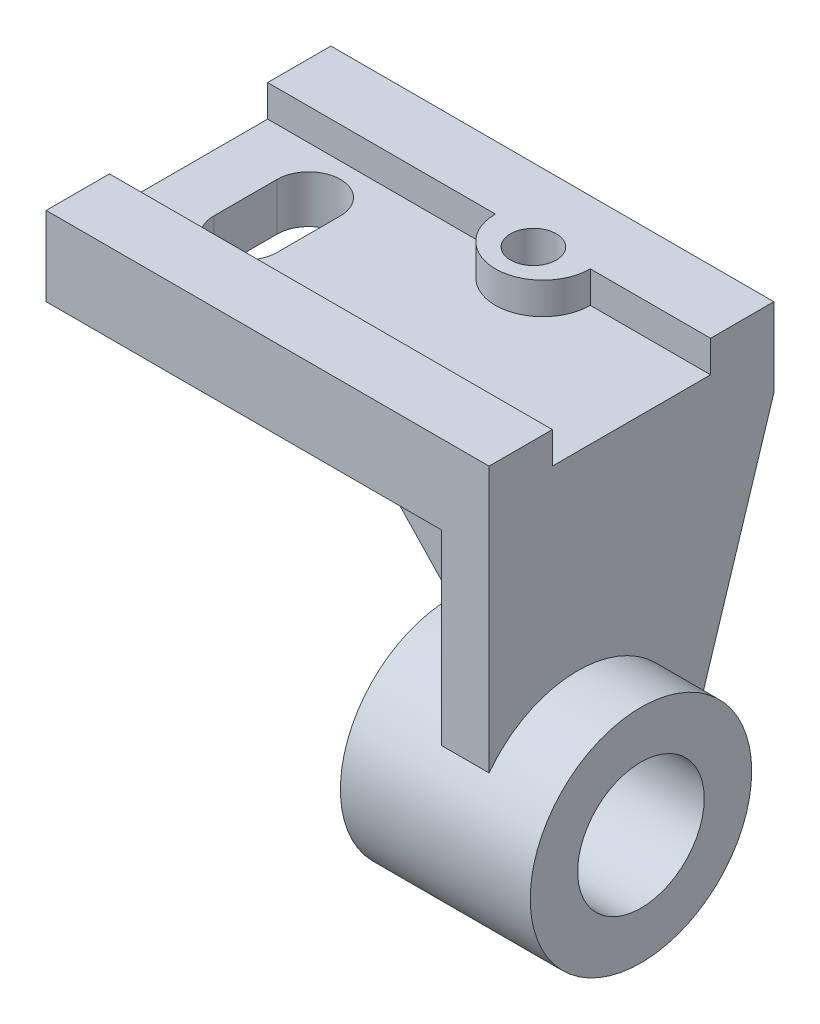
ISO-10303-21;
HEADER;
FILE_DESCRIPTION(('STEP AP214'),'2;1');
FILE_NAME('part.step','',(''),(''),'','','');
FILE_SCHEMA(('AUTOMOTIVE_DESIGN { 1 0 10303 214 1 1 1 1 }'));
ENDSEC;
DATA;
#1=APPLICATION_CONTEXT('core data for automotive mechanical design processes');
#2=APPLICATION_PROTOCOL_DEFINITION('international standard','automotive_design',2000,#1);
#3=PRODUCT_CONTEXT('',#1,'mechanical');
#4=PRODUCT('Part','Part','',(#3));
#5=PRODUCT_RELATED_PRODUCT_CATEGORY('part','',(#4));
#6=PRODUCT_DEFINITION_FORMATION('','',#4);
#7=PRODUCT_DEFINITION_CONTEXT('part definition',#1,'design');
#8=PRODUCT_DEFINITION('design','',#6,#7);
#9=PRODUCT_DEFINITION_SHAPE('','',#8);
#10=(LENGTH_UNIT() NAMED_UNIT(*) SI_UNIT(.MILLI.,.METRE.));
#11=(NAMED_UNIT(*) PLANE_ANGLE_UNIT() SI_UNIT($,.RADIAN.));
#12=(NAMED_UNIT(*) SI_UNIT($,.STERADIAN.) SOLID_ANGLE_UNIT());
#13=UNCERTAINTY_MEASURE_WITH_UNIT(LENGTH_MEASURE(1.E-05),#10,'distance_accuracy_value','');
#14=(GEOMETRIC_REPRESENTATION_CONTEXT(3) GLOBAL_UNCERTAINTY_ASSIGNED_CONTEXT((#13)) GLOBAL_UNIT_ASSIGNED_CONTEXT((#10,
#11,#12)) REPRESENTATION_CONTEXT('',''));
#15=CARTESIAN_POINT('',(0.,0.,0.));
#16=DIRECTION('',(0.,0.,1.));
#17=DIRECTION('',(1.,0.,0.));
#18=AXIS2_PLACEMENT_3D('',#15,#16,#17);
#19=CARTESIAN_POINT('',(-15.,-80.,62.));
#20=DIRECTION('',(-1.,0.,0.));
#21=DIRECTION('',(0.,0.,1.));
#22=AXIS2_PLACEMENT_3D('',#19,#20,#21);
#23=PLANE('',#22);
#24=DIRECTION('',(0.,0.,1.));
#25=VECTOR('',#24,1.);
#26=CARTESIAN_POINT('',(-15.,0.,0.));
#27=LINE('',#26,#25);
#28=CARTESIAN_POINT('',(-15.,0.,67.));
#29=VERTEX_POINT('',#28);
#30=CARTESIAN_POINT('',(-15.,0.,90.));
#31=VERTEX_POINT('',#30);
#32=EDGE_CURVE('E47',#29,#31,#27,.T.);
#33=ORIENTED_EDGE('',*,*,#32,.F.);
#34=DIRECTION('',(0.,-1.,0.));
#35=VECTOR('',#34,1.);
#36=CARTESIAN_POINT('',(-15.,-80.,67.));
#37=LINE('',#36,#35);
#38=CARTESIAN_POINT('',(-15.,-45.3589838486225,67.));
#39=VERTEX_POINT('',#38);
#40=EDGE_CURVE('E221',#29,#39,#37,.T.);
#41=ORIENTED_EDGE('',*,*,#40,.T.);
#42=CARTESIAN_POINT('',(-15.,-80.,62.));
#43=DIRECTION('',(-1.,0.,0.));
#44=DIRECTION('',(0.,0.,1.));
#45=AXIS2_PLACEMENT_3D('',#42,#43,#44);
#46=CIRCLE('',#45,35.);
#47=CARTESIAN_POINT('',(-15.,-59.,90.));
#48=VERTEX_POINT('',#47);
#49=EDGE_CURVE('E241',#48,#39,#46,.T.);
#50=ORIENTED_EDGE('',*,*,#49,.F.);
#51=DIRECTION('',(0.,-1.,0.));
#52=VECTOR('',#51,1.);
#53=CARTESIAN_POINT('',(-15.,0.,90.));
#54=LINE('',#53,#52);
#55=EDGE_CURVE('E248',#31,#48,#54,.T.);
#56=ORIENTED_EDGE('',*,*,#55,.F.);
#57=EDGE_LOOP('',(#33,#41,#50,#56));
#58=FACE_BOUND('',#57,.T.);
#59=ADVANCED_FACE('F43',(#58),#23,.T.);
#60=CARTESIAN_POINT('',(0.,0.,0.));
#61=DIRECTION('',(0.,-1.,0.));
#62=DIRECTION('',(0.,0.,-1.));
#63=AXIS2_PLACEMENT_3D('',#60,#61,#62);
#64=PLANE('',#63);
#65=DIRECTION('',(-1.,0.,0.));
#66=VECTOR('',#65,1.);
#67=CARTESIAN_POINT('',(-60.0000125,0.,57.));
#68=LINE('',#67,#66);
#69=CARTESIAN_POINT('',(-73.,0.,57.));
#70=VERTEX_POINT('',#69);
#71=CARTESIAN_POINT('',(-15.,0.,57.));
#72=VERTEX_POINT('',#71);
#73=EDGE_CURVE('E60',#70,#72,#68,.F.);
#74=ORIENTED_EDGE('',*,*,#73,.F.);
#75=DIRECTION('',(0.,0.,-1.));
#76=VECTOR('',#75,1.);
#77=CARTESIAN_POINT('',(-73.,0.,62.));
#78=LINE('',#77,#76);
#79=CARTESIAN_POINT('',(-73.,0.,67.));
#80=VERTEX_POINT('',#79);
#81=EDGE_CURVE('E64',#80,#70,#78,.T.);
#82=ORIENTED_EDGE('',*,*,#81,.F.);
#83=DIRECTION('',(-1.,0.,0.));
#84=VECTOR('',#83,1.);
#85=CARTESIAN_POINT('',(-60.0000125,0.,67.));
#86=LINE('',#85,#84);
#87=EDGE_CURVE('E199',#80,#29,#86,.F.);
#88=ORIENTED_EDGE('',*,*,#87,.T.);
#89=ORIENTED_EDGE('',*,*,#32,.T.);
#90=DIRECTION('',(1.,0.,0.));
#91=VECTOR('',#90,1.);
#92=CARTESIAN_POINT('',(0.,0.,90.));
#93=LINE('',#92,#91);
#94=CARTESIAN_POINT('',(-140.,0.,90.));
#95=VERTEX_POINT('',#94);
#96=EDGE_CURVE('E383',#95,#31,#93,.T.);
#97=ORIENTED_EDGE('',*,*,#96,.F.);
#98=DIRECTION('',(0.,0.,1.));
#99=VECTOR('',#98,1.);
#100=CARTESIAN_POINT('',(-140.,0.,0.));
#101=LINE('',#100,#99);
#102=CARTESIAN_POINT('',(-140.,0.,0.));
#103=VERTEX_POINT('',#102);
#104=EDGE_CURVE('E379',#103,#95,#101,.T.);
#105=ORIENTED_EDGE('',*,*,#104,.F.);
#106=DIRECTION('',(-1.,0.,0.));
#107=VECTOR('',#106,1.);
#108=CARTESIAN_POINT('',(0.,0.,0.));
#109=LINE('',#108,#107);
#110=CARTESIAN_POINT('',(-15.,0.,0.));
#111=VERTEX_POINT('',#110);
#112=EDGE_CURVE('E354',#111,#103,#109,.T.);
#113=ORIENTED_EDGE('',*,*,#112,.F.);
#114=EDGE_CURVE('E245',#111,#72,#27,.T.);
#115=ORIENTED_EDGE('',*,*,#114,.T.);
#116=EDGE_LOOP('',(#74,#82,#88,#89,#97,#105,#113,#115));
#117=FACE_BOUND('',#116,.T.);
#118=CARTESIAN_POINT('',(-53.,0.,23.));
#119=DIRECTION('',(0.,1.,0.));
#120=DIRECTION('',(0.,0.,1.));
#121=AXIS2_PLACEMENT_3D('',#118,#119,#120);
#122=CIRCLE('',#121,7.22143953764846);
#123=CARTESIAN_POINT('',(-53.,0.,30.2214395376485));
#124=VERTEX_POINT('',#123);
#125=EDGE_CURVE('E317',#124,#124,#122,.T.);
#126=ORIENTED_EDGE('',*,*,#125,.T.);
#127=EDGE_LOOP('',(#126));
#128=FACE_BOUND('',#127,.T.);
#129=CARTESIAN_POINT('',(-112.,0.,35.));
#130=DIRECTION('',(0.,1.,0.));
#131=DIRECTION('',(0.,0.,1.));
#132=AXIS2_PLACEMENT_3D('',#129,#130,#131);
#133=CIRCLE('',#132,10.);
#134=CARTESIAN_POINT('',(-102.,0.,35.));
#135=VERTEX_POINT('',#134);
#136=CARTESIAN_POINT('',(-122.,0.,35.));
#137=VERTEX_POINT('',#136);
#138=EDGE_CURVE('E287',#135,#137,#133,.T.);
#139=ORIENTED_EDGE('',*,*,#138,.T.);
#140=DIRECTION('',(0.,0.,1.));
#141=VECTOR('',#140,1.);
#142=CARTESIAN_POINT('',(-122.,0.,35.));
#143=LINE('',#142,#141);
#144=CARTESIAN_POINT('',(-122.,0.,55.));
#145=VERTEX_POINT('',#144);
#146=EDGE_CURVE('E290',#137,#145,#143,.T.);
#147=ORIENTED_EDGE('',*,*,#146,.T.);
#148=CARTESIAN_POINT('',(-112.,0.,55.));
#149=DIRECTION('',(0.,1.,0.));
#150=DIRECTION('',(0.,0.,1.));
#151=AXIS2_PLACEMENT_3D('',#148,#149,#150);
#152=CIRCLE('',#151,10.);
#153=CARTESIAN_POINT('',(-102.,0.,55.));
#154=VERTEX_POINT('',#153);
#155=EDGE_CURVE('E294',#145,#154,#152,.T.);
#156=ORIENTED_EDGE('',*,*,#155,.T.);
#157=DIRECTION('',(0.,0.,-1.));
#158=VECTOR('',#157,1.);
#159=CARTESIAN_POINT('',(-102.,0.,55.));
#160=LINE('',#159,#158);
#161=EDGE_CURVE('E297',#154,#135,#160,.T.);
#162=ORIENTED_EDGE('',*,*,#161,.T.);
#163=EDGE_LOOP('',(#139,#147,#156,#162));
#164=FACE_BOUND('',#163,.T.);
#165=ADVANCED_FACE('F410',(#117,#128,#164),#64,.T.);
#166=CARTESIAN_POINT('',(0.,25.,0.));
#167=DIRECTION('',(0.,-1.,0.));
#168=DIRECTION('',(0.,0.,-1.));
#169=AXIS2_PLACEMENT_3D('',#166,#167,#168);
#170=PLANE('',#169);
#171=CARTESIAN_POINT('',(-53.,25.,23.));
#172=DIRECTION('',(0.,1.,0.));
#173=DIRECTION('',(0.,0.,1.));
#174=AXIS2_PLACEMENT_3D('',#171,#172,#173);
#175=CIRCLE('',#174,7.22143953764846);
#176=CARTESIAN_POINT('',(-53.,25.,30.2214395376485));
#177=VERTEX_POINT('',#176);
#178=EDGE_CURVE('E310',#177,#177,#175,.T.);
#179=ORIENTED_EDGE('',*,*,#178,.F.);
#180=EDGE_LOOP('',(#179));
#181=FACE_BOUND('',#180,.T.);
#182=DIRECTION('',(0.,0.,1.));
#183=VECTOR('',#182,1.);
#184=CARTESIAN_POINT('',(-140.,25.,0.));
#185=LINE('',#184,#183);
#186=CARTESIAN_POINT('',(-140.,25.,0.));
#187=VERTEX_POINT('',#186);
#188=CARTESIAN_POINT('',(-140.,25.,20.));
#189=VERTEX_POINT('',#188);
#190=EDGE_CURVE('E372',#187,#189,#185,.T.);
#191=ORIENTED_EDGE('',*,*,#190,.T.);
#192=DIRECTION('',(-1.,0.,0.));
#193=VECTOR('',#192,1.);
#194=CARTESIAN_POINT('',(-140.,25.,20.));
#195=LINE('',#194,#193);
#196=CARTESIAN_POINT('',(-68.,25.,20.));
#197=VERTEX_POINT('',#196);
#198=EDGE_CURVE('E327',#197,#189,#195,.T.);
#199=ORIENTED_EDGE('',*,*,#198,.F.);
#200=CARTESIAN_POINT('',(-53.,25.,20.));
#201=DIRECTION('',(0.,-1.,0.));
#202=DIRECTION('',(0.,0.,1.));
#203=AXIS2_PLACEMENT_3D('',#200,#201,#202);
#204=CIRCLE('',#203,15.);
#205=CARTESIAN_POINT('',(-38.,25.,20.));
#206=VERTEX_POINT('',#205);
#207=EDGE_CURVE('E347',#206,#197,#204,.T.);
#208=ORIENTED_EDGE('',*,*,#207,.F.);
#209=DIRECTION('',(-1.,0.,0.));
#210=VECTOR('',#209,1.);
#211=CARTESIAN_POINT('',(-38.,25.,20.));
#212=LINE('',#211,#210);
#213=CARTESIAN_POINT('',(0.,25.,20.));
#214=VERTEX_POINT('',#213);
#215=EDGE_CURVE('E344',#214,#206,#212,.T.);
#216=ORIENTED_EDGE('',*,*,#215,.F.);
#217=DIRECTION('',(0.,0.,-1.));
#218=VECTOR('',#217,1.);
#219=CARTESIAN_POINT('',(0.,25.,0.));
#220=LINE('',#219,#218);
#221=CARTESIAN_POINT('',(0.,25.,0.));
#222=VERTEX_POINT('',#221);
#223=EDGE_CURVE('E369',#214,#222,#220,.T.);
#224=ORIENTED_EDGE('',*,*,#223,.T.);
#225=DIRECTION('',(-1.,0.,0.));
#226=VECTOR('',#225,1.);
#227=CARTESIAN_POINT('',(0.,25.,0.));
#228=LINE('',#227,#226);
#229=EDGE_CURVE('E368',#222,#187,#228,.T.);
#230=ORIENTED_EDGE('',*,*,#229,.T.);
#231=EDGE_LOOP('',(#191,#199,#208,#216,#224,#230));
#232=FACE_BOUND('',#231,.T.);
#233=ADVANCED_FACE('F426',(#181,#232),#170,.F.);
#234=CARTESIAN_POINT('',(0.,25.,0.));
#235=DIRECTION('',(-1.,0.,0.));
#236=DIRECTION('',(0.,0.,1.));
#237=AXIS2_PLACEMENT_3D('',#234,#235,#236);
#238=PLANE('',#237);
#239=CARTESIAN_POINT('',(0.,-80.,62.));
#240=DIRECTION('',(-1.,0.,0.));
#241=DIRECTION('',(0.,0.,1.));
#242=AXIS2_PLACEMENT_3D('',#239,#240,#241);
#243=CIRCLE('',#242,35.);
#244=CARTESIAN_POINT('',(0.,-59.,90.));
#245=VERTEX_POINT('',#244);
#246=CARTESIAN_POINT('',(0.,-90.55070893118,28.6281175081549));
#247=VERTEX_POINT('',#246);
#248=EDGE_CURVE('E237',#245,#247,#243,.T.);
#249=ORIENTED_EDGE('',*,*,#248,.T.);
#250=DIRECTION('',(0.,0.953482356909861,-0.301448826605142));
#251=VECTOR('',#250,1.);
#252=CARTESIAN_POINT('',(0.,0.,0.));
#253=LINE('',#252,#251);
#254=CARTESIAN_POINT('',(0.,0.,0.));
#255=VERTEX_POINT('',#254);
#256=EDGE_CURVE('E280',#247,#255,#253,.T.);
#257=ORIENTED_EDGE('',*,*,#256,.T.);
#258=DIRECTION('',(0.,-1.,0.));
#259=VECTOR('',#258,1.);
#260=CARTESIAN_POINT('',(0.,25.,0.));
#261=LINE('',#260,#259);
#262=EDGE_CURVE('E53',#222,#255,#261,.T.);
#263=ORIENTED_EDGE('',*,*,#262,.F.);
#264=ORIENTED_EDGE('',*,*,#223,.F.);
#265=DIRECTION('',(0.,1.,0.));
#266=VECTOR('',#265,1.);
#267=CARTESIAN_POINT('',(0.,15.,20.));
#268=LINE('',#267,#266);
#269=CARTESIAN_POINT('',(0.,15.,20.));
#270=VERTEX_POINT('',#269);
#271=EDGE_CURVE('E359',#270,#214,#268,.T.);
#272=ORIENTED_EDGE('',*,*,#271,.F.);
#273=DIRECTION('',(0.,0.,-1.));
#274=VECTOR('',#273,1.);
#275=CARTESIAN_POINT('',(0.,15.,20.));
#276=LINE('',#275,#274);
#277=CARTESIAN_POINT('',(0.,15.,70.));
#278=VERTEX_POINT('',#277);
#279=EDGE_CURVE('E330',#278,#270,#276,.T.);
#280=ORIENTED_EDGE('',*,*,#279,.F.);
#281=DIRECTION('',(0.,1.,0.));
#282=VECTOR('',#281,1.);
#283=CARTESIAN_POINT('',(0.,15.,70.));
#284=LINE('',#283,#282);
#285=CARTESIAN_POINT('',(0.,25.,70.));
#286=VERTEX_POINT('',#285);
#287=EDGE_CURVE('E361',#278,#286,#284,.T.);
#288=ORIENTED_EDGE('',*,*,#287,.T.);
#289=CARTESIAN_POINT('',(0.,25.,90.));
#290=VERTEX_POINT('',#289);
#291=EDGE_CURVE('E365',#290,#286,#220,.T.);
#292=ORIENTED_EDGE('',*,*,#291,.F.);
#293=DIRECTION('',(0.,-1.,0.));
#294=VECTOR('',#293,1.);
#295=CARTESIAN_POINT('',(0.,25.,90.));
#296=LINE('',#295,#294);
#297=EDGE_CURVE('E376',#290,#245,#296,.T.);
#298=ORIENTED_EDGE('',*,*,#297,.T.);
#299=EDGE_LOOP('',(#249,#257,#263,#264,#272,#280,#288,#292,#298));
#300=FACE_BOUND('',#299,.T.);
#301=ADVANCED_FACE('F45',(#300),#238,.F.);
#302=CARTESIAN_POINT('',(0.,25.,0.));
#303=DIRECTION('',(0.,0.,1.));
#304=DIRECTION('',(1.,0.,0.));
#305=AXIS2_PLACEMENT_3D('',#302,#303,#304);
#306=PLANE('',#305);
#307=EDGE_CURVE('E249',#255,#111,#109,.T.);
#308=ORIENTED_EDGE('',*,*,#307,.T.);
#309=ORIENTED_EDGE('',*,*,#112,.T.);
#310=DIRECTION('',(0.,-1.,0.));
#311=VECTOR('',#310,1.);
#312=CARTESIAN_POINT('',(-140.,25.,0.));
#313=LINE('',#312,#311);
#314=EDGE_CURVE('E392',#187,#103,#313,.T.);
#315=ORIENTED_EDGE('',*,*,#314,.F.);
#316=ORIENTED_EDGE('',*,*,#229,.F.);
#317=ORIENTED_EDGE('',*,*,#262,.T.);
#318=EDGE_LOOP('',(#308,#309,#315,#316,#317));
#319=FACE_BOUND('',#318,.T.);
#320=ADVANCED_FACE('F403',(#319),#306,.F.);
#321=CARTESIAN_POINT('',(-140.,25.,0.));
#322=DIRECTION('',(1.,0.,0.));
#323=DIRECTION('',(0.,0.,-1.));
#324=AXIS2_PLACEMENT_3D('',#321,#322,#323);
#325=PLANE('',#324);
#326=DIRECTION('',(0.,0.,1.));
#327=VECTOR('',#326,1.);
#328=CARTESIAN_POINT('',(-140.,15.,70.));
#329=LINE('',#328,#327);
#330=CARTESIAN_POINT('',(-140.,15.,20.));
#331=VERTEX_POINT('',#330);
#332=CARTESIAN_POINT('',(-140.,15.,70.));
#333=VERTEX_POINT('',#332);
#334=EDGE_CURVE('E323',#331,#333,#329,.T.);
#335=ORIENTED_EDGE('',*,*,#334,.F.);
#336=DIRECTION('',(0.,1.,0.));
#337=VECTOR('',#336,1.);
#338=CARTESIAN_POINT('',(-140.,15.,20.));
#339=LINE('',#338,#337);
#340=EDGE_CURVE('E351',#331,#189,#339,.T.);
#341=ORIENTED_EDGE('',*,*,#340,.T.);
#342=ORIENTED_EDGE('',*,*,#190,.F.);
#343=ORIENTED_EDGE('',*,*,#314,.T.);
#344=ORIENTED_EDGE('',*,*,#104,.T.);
#345=DIRECTION('',(0.,-1.,0.));
#346=VECTOR('',#345,1.);
#347=CARTESIAN_POINT('',(-140.,25.,90.));
#348=LINE('',#347,#346);
#349=CARTESIAN_POINT('',(-140.,25.,90.));
#350=VERTEX_POINT('',#349);
#351=EDGE_CURVE('E390',#350,#95,#348,.T.);
#352=ORIENTED_EDGE('',*,*,#351,.F.);
#353=CARTESIAN_POINT('',(-140.,25.,70.));
#354=VERTEX_POINT('',#353);
#355=EDGE_CURVE('E371',#354,#350,#185,.T.);
#356=ORIENTED_EDGE('',*,*,#355,.F.);
#357=DIRECTION('',(0.,1.,0.));
#358=VECTOR('',#357,1.);
#359=CARTESIAN_POINT('',(-140.,15.,70.));
#360=LINE('',#359,#358);
#361=EDGE_CURVE('E342',#333,#354,#360,.T.);
#362=ORIENTED_EDGE('',*,*,#361,.F.);
#363=EDGE_LOOP('',(#335,#341,#342,#343,#344,#352,#356,#362));
#364=FACE_BOUND('',#363,.T.);
#365=ADVANCED_FACE('F422',(#364),#325,.F.);
#366=CARTESIAN_POINT('',(0.,25.,90.));
#367=DIRECTION('',(0.,0.,-1.));
#368=DIRECTION('',(-1.,0.,0.));
#369=AXIS2_PLACEMENT_3D('',#366,#367,#368);
#370=PLANE('',#369);
#371=ORIENTED_EDGE('',*,*,#96,.T.);
#372=ORIENTED_EDGE('',*,*,#55,.T.);
#373=DIRECTION('',(1.,0.,0.));
#374=VECTOR('',#373,1.);
#375=CARTESIAN_POINT('',(-15.,-59.,90.));
#376=LINE('',#375,#374);
#377=EDGE_CURVE('E260',#48,#245,#376,.T.);
#378=ORIENTED_EDGE('',*,*,#377,.T.);
#379=ORIENTED_EDGE('',*,*,#297,.F.);
#380=DIRECTION('',(1.,0.,0.));
#381=VECTOR('',#380,1.);
#382=CARTESIAN_POINT('',(0.,25.,90.));
#383=LINE('',#382,#381);
#384=EDGE_CURVE('E375',#350,#290,#383,.T.);
#385=ORIENTED_EDGE('',*,*,#384,.F.);
#386=ORIENTED_EDGE('',*,*,#351,.T.);
#387=EDGE_LOOP('',(#371,#372,#378,#379,#385,#386));
#388=FACE_BOUND('',#387,.T.);
#389=ADVANCED_FACE('F416',(#388),#370,.F.);
#390=ORIENTED_EDGE('',*,*,#291,.T.);
#391=DIRECTION('',(1.,0.,0.));
#392=VECTOR('',#391,1.);
#393=CARTESIAN_POINT('',(0.,25.,70.));
#394=LINE('',#393,#392);
#395=EDGE_CURVE('E320',#354,#286,#394,.T.);
#396=ORIENTED_EDGE('',*,*,#395,.F.);
#397=ORIENTED_EDGE('',*,*,#355,.T.);
#398=ORIENTED_EDGE('',*,*,#384,.T.);
#399=EDGE_LOOP('',(#390,#396,#397,#398));
#400=FACE_BOUND('',#399,.T.);
#401=ADVANCED_FACE('F440',(#400),#170,.F.);
#402=CARTESIAN_POINT('',(-140.,15.,20.));
#403=DIRECTION('',(0.,0.,-1.));
#404=DIRECTION('',(-1.,0.,0.));
#405=AXIS2_PLACEMENT_3D('',#402,#403,#404);
#406=PLANE('',#405);
#407=ORIENTED_EDGE('',*,*,#198,.T.);
#408=ORIENTED_EDGE('',*,*,#340,.F.);
#409=DIRECTION('',(-1.,0.,0.));
#410=VECTOR('',#409,1.);
#411=CARTESIAN_POINT('',(-140.,15.,20.));
#412=LINE('',#411,#410);
#413=CARTESIAN_POINT('',(-68.,15.,20.));
#414=VERTEX_POINT('',#413);
#415=EDGE_CURVE('E339',#414,#331,#412,.T.);
#416=ORIENTED_EDGE('',*,*,#415,.F.);
#417=DIRECTION('',(0.,1.,0.));
#418=VECTOR('',#417,1.);
#419=CARTESIAN_POINT('',(-68.,15.,20.));
#420=LINE('',#419,#418);
#421=EDGE_CURVE('E355',#414,#197,#420,.T.);
#422=ORIENTED_EDGE('',*,*,#421,.T.);
#423=EDGE_LOOP('',(#407,#408,#416,#422));
#424=FACE_BOUND('',#423,.T.);
#425=ADVANCED_FACE('F442',(#424),#406,.F.);
#426=CARTESIAN_POINT('',(-53.,15.,20.));
#427=DIRECTION('',(0.,1.,0.));
#428=DIRECTION('',(0.,0.,1.));
#429=AXIS2_PLACEMENT_3D('',#426,#427,#428);
#430=CYLINDRICAL_SURFACE('',#429,15.);
#431=ORIENTED_EDGE('',*,*,#207,.T.);
#432=ORIENTED_EDGE('',*,*,#421,.F.);
#433=CARTESIAN_POINT('',(-53.,15.,20.));
#434=DIRECTION('',(0.,-1.,0.));
#435=DIRECTION('',(0.,0.,1.));
#436=AXIS2_PLACEMENT_3D('',#433,#434,#435);
#437=CIRCLE('',#436,15.);
#438=CARTESIAN_POINT('',(-38.,15.,20.));
#439=VERTEX_POINT('',#438);
#440=EDGE_CURVE('E336',#439,#414,#437,.T.);
#441=ORIENTED_EDGE('',*,*,#440,.F.);
#442=DIRECTION('',(0.,1.,0.));
#443=VECTOR('',#442,1.);
#444=CARTESIAN_POINT('',(-38.,15.,20.));
#445=LINE('',#444,#443);
#446=EDGE_CURVE('E357',#439,#206,#445,.T.);
#447=ORIENTED_EDGE('',*,*,#446,.T.);
#448=EDGE_LOOP('',(#431,#432,#441,#447));
#449=FACE_BOUND('',#448,.T.);
#450=ADVANCED_FACE('F448',(#449),#430,.T.);
#451=CARTESIAN_POINT('',(-38.,15.,20.));
#452=DIRECTION('',(0.,0.,-1.));
#453=DIRECTION('',(-1.,0.,0.));
#454=AXIS2_PLACEMENT_3D('',#451,#452,#453);
#455=PLANE('',#454);
#456=ORIENTED_EDGE('',*,*,#215,.T.);
#457=ORIENTED_EDGE('',*,*,#446,.F.);
#458=DIRECTION('',(-1.,0.,0.));
#459=VECTOR('',#458,1.);
#460=CARTESIAN_POINT('',(-38.,15.,20.));
#461=LINE('',#460,#459);
#462=EDGE_CURVE('E333',#270,#439,#461,.T.);
#463=ORIENTED_EDGE('',*,*,#462,.F.);
#464=ORIENTED_EDGE('',*,*,#271,.T.);
#465=EDGE_LOOP('',(#456,#457,#463,#464));
#466=FACE_BOUND('',#465,.T.);
#467=ADVANCED_FACE('F430',(#466),#455,.F.);
#468=CARTESIAN_POINT('',(0.,15.,70.));
#469=DIRECTION('',(0.,0.,1.));
#470=DIRECTION('',(1.,0.,0.));
#471=AXIS2_PLACEMENT_3D('',#468,#469,#470);
#472=PLANE('',#471);
#473=ORIENTED_EDGE('',*,*,#395,.T.);
#474=ORIENTED_EDGE('',*,*,#287,.F.);
#475=DIRECTION('',(1.,0.,0.));
#476=VECTOR('',#475,1.);
#477=CARTESIAN_POINT('',(0.,15.,70.));
#478=LINE('',#477,#476);
#479=EDGE_CURVE('E326',#333,#278,#478,.T.);
#480=ORIENTED_EDGE('',*,*,#479,.F.);
#481=ORIENTED_EDGE('',*,*,#361,.T.);
#482=EDGE_LOOP('',(#473,#474,#480,#481));
#483=FACE_BOUND('',#482,.T.);
#484=ADVANCED_FACE('F437',(#483),#472,.F.);
#485=CARTESIAN_POINT('',(-53.,15.,20.));
#486=DIRECTION('',(0.,1.,0.));
#487=DIRECTION('',(0.,0.,1.));
#488=AXIS2_PLACEMENT_3D('',#485,#486,#487);
#489=PLANE('',#488);
#490=CARTESIAN_POINT('',(-112.,15.,35.));
#491=DIRECTION('',(0.,1.,0.));
#492=DIRECTION('',(0.,0.,1.));
#493=AXIS2_PLACEMENT_3D('',#490,#491,#492);
#494=CIRCLE('',#493,10.);
#495=CARTESIAN_POINT('',(-102.,15.,35.));
#496=VERTEX_POINT('',#495);
#497=CARTESIAN_POINT('',(-122.,15.,35.));
#498=VERTEX_POINT('',#497);
#499=EDGE_CURVE('E281',#496,#498,#494,.T.);
#500=ORIENTED_EDGE('',*,*,#499,.F.);
#501=DIRECTION('',(0.,0.,-1.));
#502=VECTOR('',#501,1.);
#503=CARTESIAN_POINT('',(-102.,15.,55.));
#504=LINE('',#503,#502);
#505=CARTESIAN_POINT('',(-102.,15.,55.));
#506=VERTEX_POINT('',#505);
#507=EDGE_CURVE('E291',#506,#496,#504,.T.);
#508=ORIENTED_EDGE('',*,*,#507,.F.);
#509=CARTESIAN_POINT('',(-112.,15.,55.));
#510=DIRECTION('',(0.,1.,0.));
#511=DIRECTION('',(0.,0.,1.));
#512=AXIS2_PLACEMENT_3D('',#509,#510,#511);
#513=CIRCLE('',#512,10.);
#514=CARTESIAN_POINT('',(-122.,15.,55.));
#515=VERTEX_POINT('',#514);
#516=EDGE_CURVE('E303',#515,#506,#513,.T.);
#517=ORIENTED_EDGE('',*,*,#516,.F.);
#518=DIRECTION('',(0.,0.,1.));
#519=VECTOR('',#518,1.);
#520=CARTESIAN_POINT('',(-122.,15.,35.));
#521=LINE('',#520,#519);
#522=EDGE_CURVE('E283',#498,#515,#521,.T.);
#523=ORIENTED_EDGE('',*,*,#522,.F.);
#524=EDGE_LOOP('',(#500,#508,#517,#523));
#525=FACE_BOUND('',#524,.T.);
#526=ORIENTED_EDGE('',*,*,#334,.T.);
#527=ORIENTED_EDGE('',*,*,#479,.T.);
#528=ORIENTED_EDGE('',*,*,#279,.T.);
#529=ORIENTED_EDGE('',*,*,#462,.T.);
#530=ORIENTED_EDGE('',*,*,#440,.T.);
#531=ORIENTED_EDGE('',*,*,#415,.T.);
#532=EDGE_LOOP('',(#526,#527,#528,#529,#530,#531));
#533=FACE_BOUND('',#532,.T.);
#534=ADVANCED_FACE('F435',(#525,#533),#489,.T.);
#535=CARTESIAN_POINT('',(-53.,0.,23.));
#536=DIRECTION('',(0.,1.,0.));
#537=DIRECTION('',(0.,0.,1.));
#538=AXIS2_PLACEMENT_3D('',#535,#536,#537);
#539=CYLINDRICAL_SURFACE('',#538,7.22143953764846);
#540=ORIENTED_EDGE('',*,*,#125,.F.);
#541=EDGE_LOOP('',(#540));
#542=FACE_BOUND('',#541,.T.);
#543=ORIENTED_EDGE('',*,*,#178,.T.);
#544=EDGE_LOOP('',(#543));
#545=FACE_BOUND('',#544,.T.);
#546=ADVANCED_FACE('F488',(#542,#545),#539,.F.);
#547=CARTESIAN_POINT('',(-112.,0.,35.));
#548=DIRECTION('',(0.,1.,0.));
#549=DIRECTION('',(0.,0.,1.));
#550=AXIS2_PLACEMENT_3D('',#547,#548,#549);
#551=CYLINDRICAL_SURFACE('',#550,10.);
#552=ORIENTED_EDGE('',*,*,#499,.T.);
#553=DIRECTION('',(0.,1.,0.));
#554=VECTOR('',#553,1.);
#555=CARTESIAN_POINT('',(-122.,0.,35.));
#556=LINE('',#555,#554);
#557=EDGE_CURVE('E299',#137,#498,#556,.T.);
#558=ORIENTED_EDGE('',*,*,#557,.F.);
#559=ORIENTED_EDGE('',*,*,#138,.F.);
#560=DIRECTION('',(0.,1.,0.));
#561=VECTOR('',#560,1.);
#562=CARTESIAN_POINT('',(-102.,0.,35.));
#563=LINE('',#562,#561);
#564=EDGE_CURVE('E308',#135,#496,#563,.T.);
#565=ORIENTED_EDGE('',*,*,#564,.T.);
#566=EDGE_LOOP('',(#552,#558,#559,#565));
#567=FACE_BOUND('',#566,.T.);
#568=ADVANCED_FACE('F481',(#567),#551,.F.);
#569=CARTESIAN_POINT('',(-102.,0.,55.));
#570=DIRECTION('',(1.,0.,0.));
#571=DIRECTION('',(0.,0.,-1.));
#572=AXIS2_PLACEMENT_3D('',#569,#570,#571);
#573=PLANE('',#572);
#574=ORIENTED_EDGE('',*,*,#507,.T.);
#575=ORIENTED_EDGE('',*,*,#564,.F.);
#576=ORIENTED_EDGE('',*,*,#161,.F.);
#577=DIRECTION('',(0.,1.,0.));
#578=VECTOR('',#577,1.);
#579=CARTESIAN_POINT('',(-102.,0.,55.));
#580=LINE('',#579,#578);
#581=EDGE_CURVE('E311',#154,#506,#580,.T.);
#582=ORIENTED_EDGE('',*,*,#581,.T.);
#583=EDGE_LOOP('',(#574,#575,#576,#582));
#584=FACE_BOUND('',#583,.T.);
#585=ADVANCED_FACE('F478',(#584),#573,.F.);
#586=CARTESIAN_POINT('',(-112.,0.,55.));
#587=DIRECTION('',(0.,1.,0.));
#588=DIRECTION('',(0.,0.,1.));
#589=AXIS2_PLACEMENT_3D('',#586,#587,#588);
#590=CYLINDRICAL_SURFACE('',#589,10.);
#591=ORIENTED_EDGE('',*,*,#516,.T.);
#592=ORIENTED_EDGE('',*,*,#581,.F.);
#593=ORIENTED_EDGE('',*,*,#155,.F.);
#594=DIRECTION('',(0.,1.,0.));
#595=VECTOR('',#594,1.);
#596=CARTESIAN_POINT('',(-122.,0.,55.));
#597=LINE('',#596,#595);
#598=EDGE_CURVE('E313',#145,#515,#597,.T.);
#599=ORIENTED_EDGE('',*,*,#598,.T.);
#600=EDGE_LOOP('',(#591,#592,#593,#599));
#601=FACE_BOUND('',#600,.T.);
#602=ADVANCED_FACE('F474',(#601),#590,.F.);
#603=CARTESIAN_POINT('',(-122.,0.,35.));
#604=DIRECTION('',(-1.,0.,0.));
#605=DIRECTION('',(0.,0.,1.));
#606=AXIS2_PLACEMENT_3D('',#603,#604,#605);
#607=PLANE('',#606);
#608=ORIENTED_EDGE('',*,*,#522,.T.);
#609=ORIENTED_EDGE('',*,*,#598,.F.);
#610=ORIENTED_EDGE('',*,*,#146,.F.);
#611=ORIENTED_EDGE('',*,*,#557,.T.);
#612=EDGE_LOOP('',(#608,#609,#610,#611));
#613=FACE_BOUND('',#612,.T.);
#614=ADVANCED_FACE('F470',(#613),#607,.F.);
#615=CARTESIAN_POINT('',(-15.,0.,0.));
#616=DIRECTION('',(0.,-0.301448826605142,-0.953482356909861));
#617=DIRECTION('',(0.,0.953482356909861,-0.301448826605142));
#618=AXIS2_PLACEMENT_3D('',#615,#616,#617);
#619=PLANE('',#618);
#620=ORIENTED_EDGE('',*,*,#256,.F.);
#621=DIRECTION('',(1.,0.,0.));
#622=VECTOR('',#621,1.);
#623=CARTESIAN_POINT('',(-15.,-90.55070893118,28.6281175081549));
#624=LINE('',#623,#622);
#625=CARTESIAN_POINT('',(-15.,-90.55070893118,28.6281175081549));
#626=VERTEX_POINT('',#625);
#627=EDGE_CURVE('E267',#626,#247,#624,.T.);
#628=ORIENTED_EDGE('',*,*,#627,.F.);
#629=DIRECTION('',(0.,0.953482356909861,-0.301448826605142));
#630=VECTOR('',#629,1.);
#631=CARTESIAN_POINT('',(-15.,0.,0.));
#632=LINE('',#631,#630);
#633=EDGE_CURVE('E257',#626,#111,#632,.T.);
#634=ORIENTED_EDGE('',*,*,#633,.T.);
#635=ORIENTED_EDGE('',*,*,#307,.F.);
#636=EDGE_LOOP('',(#620,#628,#634,#635));
#637=FACE_BOUND('',#636,.T.);
#638=ADVANCED_FACE('F278',(#637),#619,.T.);
#639=DIRECTION('',(0.,-1.,0.));
#640=VECTOR('',#639,1.);
#641=CARTESIAN_POINT('',(-15.,-80.,57.));
#642=LINE('',#641,#640);
#643=CARTESIAN_POINT('',(-15.,-45.3589838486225,57.));
#644=VERTEX_POINT('',#643);
#645=EDGE_CURVE('E225',#72,#644,#642,.T.);
#646=ORIENTED_EDGE('',*,*,#645,.F.);
#647=ORIENTED_EDGE('',*,*,#114,.F.);
#648=ORIENTED_EDGE('',*,*,#633,.F.);
#649=EDGE_CURVE('E254',#644,#626,#46,.T.);
#650=ORIENTED_EDGE('',*,*,#649,.F.);
#651=EDGE_LOOP('',(#646,#647,#648,#650));
#652=FACE_BOUND('',#651,.T.);
#653=ADVANCED_FACE('F276',(#652),#23,.T.);
#654=CARTESIAN_POINT('',(20.,-80.,62.));
#655=DIRECTION('',(-1.,0.,0.));
#656=DIRECTION('',(0.,0.,1.));
#657=AXIS2_PLACEMENT_3D('',#654,#655,#656);
#658=CYLINDRICAL_SURFACE('',#657,35.);
#659=CARTESIAN_POINT('',(20.,-80.,62.));
#660=DIRECTION('',(1.,0.,0.));
#661=DIRECTION('',(0.,0.,-1.));
#662=AXIS2_PLACEMENT_3D('',#659,#660,#661);
#663=CIRCLE('',#662,35.);
#664=CARTESIAN_POINT('',(20.,-80.,27.));
#665=VERTEX_POINT('',#664);
#666=EDGE_CURVE('E234',#665,#665,#663,.T.);
#667=ORIENTED_EDGE('',*,*,#666,.F.);
#668=EDGE_LOOP('',(#667));
#669=FACE_BOUND('',#668,.T.);
#670=CARTESIAN_POINT('',(-40.,-80.,62.));
#671=DIRECTION('',(1.,0.,0.));
#672=DIRECTION('',(0.,0.,-1.));
#673=AXIS2_PLACEMENT_3D('',#670,#671,#672);
#674=CIRCLE('',#673,35.);
#675=CARTESIAN_POINT('',(-40.,-80.,27.));
#676=VERTEX_POINT('',#675);
#677=EDGE_CURVE('E231',#676,#676,#674,.T.);
#678=ORIENTED_EDGE('',*,*,#677,.T.);
#679=EDGE_LOOP('',(#678));
#680=FACE_BOUND('',#679,.T.);
#681=ORIENTED_EDGE('',*,*,#627,.T.);
#682=ORIENTED_EDGE('',*,*,#248,.F.);
#683=ORIENTED_EDGE('',*,*,#377,.F.);
#684=ORIENTED_EDGE('',*,*,#49,.T.);
#685=DIRECTION('',(-1.,0.,0.));
#686=VECTOR('',#685,1.);
#687=CARTESIAN_POINT('',(20.,-45.3589838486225,67.));
#688=LINE('',#687,#686);
#689=CARTESIAN_POINT('',(-35.,-45.3589838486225,67.));
#690=VERTEX_POINT('',#689);
#691=EDGE_CURVE('E208',#690,#39,#688,.F.);
#692=ORIENTED_EDGE('',*,*,#691,.F.);
#693=CARTESIAN_POINT('',(-35.,-80.,62.));
#694=DIRECTION('',(-1.,0.,0.));
#695=DIRECTION('',(0.,0.,1.));
#696=AXIS2_PLACEMENT_3D('',#693,#694,#695);
#697=CIRCLE('',#696,35.);
#698=CARTESIAN_POINT('',(-35.,-45.3589838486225,57.));
#699=VERTEX_POINT('',#698);
#700=EDGE_CURVE('E13',#690,#699,#697,.T.);
#701=ORIENTED_EDGE('',*,*,#700,.T.);
#702=DIRECTION('',(-1.,0.,0.));
#703=VECTOR('',#702,1.);
#704=CARTESIAN_POINT('',(20.,-45.3589838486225,57.));
#705=LINE('',#704,#703);
#706=EDGE_CURVE('E196',#699,#644,#705,.F.);
#707=ORIENTED_EDGE('',*,*,#706,.T.);
#708=ORIENTED_EDGE('',*,*,#649,.T.);
#709=EDGE_LOOP('',(#681,#682,#683,#684,#692,#701,#707,#708));
#710=FACE_BOUND('',#709,.T.);
#711=ADVANCED_FACE('F273',(#669,#680,#710),#658,.T.);
#712=CARTESIAN_POINT('',(20.,-80.,62.));
#713=DIRECTION('',(1.,0.,0.));
#714=DIRECTION('',(0.,0.,-1.));
#715=AXIS2_PLACEMENT_3D('',#712,#713,#714);
#716=PLANE('',#715);
#717=ORIENTED_EDGE('',*,*,#666,.T.);
#718=EDGE_LOOP('',(#717));
#719=FACE_BOUND('',#718,.T.);
#720=CARTESIAN_POINT('',(20.,-80.,62.));
#721=DIRECTION('',(1.,0.,0.));
#722=DIRECTION('',(0.,0.,-1.));
#723=AXIS2_PLACEMENT_3D('',#720,#721,#722);
#724=CIRCLE('',#723,20.);
#725=CARTESIAN_POINT('',(20.,-80.,42.));
#726=VERTEX_POINT('',#725);
#727=EDGE_CURVE('E228',#726,#726,#724,.T.);
#728=ORIENTED_EDGE('',*,*,#727,.F.);
#729=EDGE_LOOP('',(#728));
#730=FACE_BOUND('',#729,.T.);
#731=ADVANCED_FACE('F468',(#719,#730),#716,.T.);
#732=CARTESIAN_POINT('',(-40.,-80.,62.));
#733=DIRECTION('',(1.,0.,0.));
#734=DIRECTION('',(0.,0.,-1.));
#735=AXIS2_PLACEMENT_3D('',#732,#733,#734);
#736=PLANE('',#735);
#737=ORIENTED_EDGE('',*,*,#677,.F.);
#738=EDGE_LOOP('',(#737));
#739=FACE_BOUND('',#738,.T.);
#740=CARTESIAN_POINT('',(-40.,-80.,62.));
#741=DIRECTION('',(1.,0.,0.));
#742=DIRECTION('',(0.,0.,-1.));
#743=AXIS2_PLACEMENT_3D('',#740,#741,#742);
#744=CIRCLE('',#743,20.);
#745=CARTESIAN_POINT('',(-40.,-80.,42.));
#746=VERTEX_POINT('',#745);
#747=EDGE_CURVE('E227',#746,#746,#744,.T.);
#748=ORIENTED_EDGE('',*,*,#747,.T.);
#749=EDGE_LOOP('',(#748));
#750=FACE_BOUND('',#749,.T.);
#751=ADVANCED_FACE('F560',(#739,#750),#736,.F.);
#752=CARTESIAN_POINT('',(20.,-80.,62.));
#753=DIRECTION('',(-1.,0.,0.));
#754=DIRECTION('',(0.,0.,1.));
#755=AXIS2_PLACEMENT_3D('',#752,#753,#754);
#756=CYLINDRICAL_SURFACE('',#755,20.);
#757=ORIENTED_EDGE('',*,*,#727,.T.);
#758=EDGE_LOOP('',(#757));
#759=FACE_BOUND('',#758,.T.);
#760=ORIENTED_EDGE('',*,*,#747,.F.);
#761=EDGE_LOOP('',(#760));
#762=FACE_BOUND('',#761,.T.);
#763=ADVANCED_FACE('F565',(#759,#762),#756,.F.);
#764=CARTESIAN_POINT('',(-35.,-50.,62.));
#765=DIRECTION('',(-1.,0.,0.));
#766=DIRECTION('',(0.,1.,0.));
#767=AXIS2_PLACEMENT_3D('',#764,#765,#766);
#768=PLANE('',#767);
#769=ORIENTED_EDGE('',*,*,#700,.F.);
#770=DIRECTION('',(0.,1.,0.));
#771=VECTOR('',#770,1.);
#772=CARTESIAN_POINT('',(-35.,-45.,67.));
#773=LINE('',#772,#771);
#774=CARTESIAN_POINT('',(-35.,-40.,67.));
#775=VERTEX_POINT('',#774);
#776=EDGE_CURVE('E205',#690,#775,#773,.T.);
#777=ORIENTED_EDGE('',*,*,#776,.T.);
#778=DIRECTION('',(0.,0.,-1.));
#779=VECTOR('',#778,1.);
#780=CARTESIAN_POINT('',(-35.,-40.,62.));
#781=LINE('',#780,#779);
#782=CARTESIAN_POINT('',(-35.,-40.,57.));
#783=VERTEX_POINT('',#782);
#784=EDGE_CURVE('E202',#775,#783,#781,.T.);
#785=ORIENTED_EDGE('',*,*,#784,.T.);
#786=DIRECTION('',(0.,1.,0.));
#787=VECTOR('',#786,1.);
#788=CARTESIAN_POINT('',(-35.,-45.,57.));
#789=LINE('',#788,#787);
#790=EDGE_CURVE('E190',#699,#783,#789,.T.);
#791=ORIENTED_EDGE('',*,*,#790,.F.);
#792=EDGE_LOOP('',(#769,#777,#785,#791));
#793=FACE_BOUND('',#792,.T.);
#794=ADVANCED_FACE('F203',(#793),#768,.T.);
#795=CARTESIAN_POINT('',(-35.,-40.,62.));
#796=DIRECTION('',(-0.724999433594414,-0.688749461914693,0.));
#797=DIRECTION('',(-0.688749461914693,0.724999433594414,0.));
#798=AXIS2_PLACEMENT_3D('',#795,#796,#797);
#799=PLANE('',#798);
#800=ORIENTED_EDGE('',*,*,#784,.F.);
#801=DIRECTION('',(-0.688749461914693,0.724999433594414,0.));
#802=VECTOR('',#801,1.);
#803=CARTESIAN_POINT('',(-35.,-40.,67.));
#804=LINE('',#803,#802);
#805=EDGE_CURVE('E214',#775,#80,#804,.T.);
#806=ORIENTED_EDGE('',*,*,#805,.T.);
#807=ORIENTED_EDGE('',*,*,#81,.T.);
#808=DIRECTION('',(-0.688749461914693,0.724999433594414,0.));
#809=VECTOR('',#808,1.);
#810=CARTESIAN_POINT('',(-35.,-40.,57.));
#811=LINE('',#810,#809);
#812=EDGE_CURVE('E194',#783,#70,#811,.T.);
#813=ORIENTED_EDGE('',*,*,#812,.F.);
#814=EDGE_LOOP('',(#800,#806,#807,#813));
#815=FACE_BOUND('',#814,.T.);
#816=ADVANCED_FACE('F210',(#815),#799,.T.);
#817=CARTESIAN_POINT('',(-60.0000125,-45.,57.));
#818=DIRECTION('',(0.,0.,-1.));
#819=DIRECTION('',(-1.,0.,0.));
#820=AXIS2_PLACEMENT_3D('',#817,#818,#819);
#821=PLANE('',#820);
#822=ORIENTED_EDGE('',*,*,#73,.T.);
#823=ORIENTED_EDGE('',*,*,#645,.T.);
#824=ORIENTED_EDGE('',*,*,#706,.F.);
#825=ORIENTED_EDGE('',*,*,#790,.T.);
#826=ORIENTED_EDGE('',*,*,#812,.T.);
#827=EDGE_LOOP('',(#822,#823,#824,#825,#826));
#828=FACE_BOUND('',#827,.T.);
#829=ADVANCED_FACE('F192',(#828),#821,.T.);
#830=CARTESIAN_POINT('',(-60.0000125,-45.,67.));
#831=DIRECTION('',(0.,0.,-1.));
#832=DIRECTION('',(-1.,0.,0.));
#833=AXIS2_PLACEMENT_3D('',#830,#831,#832);
#834=PLANE('',#833);
#835=ORIENTED_EDGE('',*,*,#40,.F.);
#836=ORIENTED_EDGE('',*,*,#87,.F.);
#837=ORIENTED_EDGE('',*,*,#805,.F.);
#838=ORIENTED_EDGE('',*,*,#776,.F.);
#839=ORIENTED_EDGE('',*,*,#691,.T.);
#840=EDGE_LOOP('',(#835,#836,#837,#838,#839));
#841=FACE_BOUND('',#840,.T.);
#842=ADVANCED_FACE('F632',(#841),#834,.F.);
#843=CLOSED_SHELL('',(#59,#165,#233,#301,#320,#365,#389,#401,#425,#450,#467,#484,#534,#546,#568,
#585,#602,#614,#638,#653,#711,#731,#751,#763,#794,#816,#829,#842));
#844=MANIFOLD_SOLID_BREP('B2',#843);
#845=ADVANCED_BREP_SHAPE_REPRESENTATION('',(#18,#844),#14);
#846=SHAPE_DEFINITION_REPRESENTATION(#9,#845);
ENDSEC;
END-ISO-10303-21;
